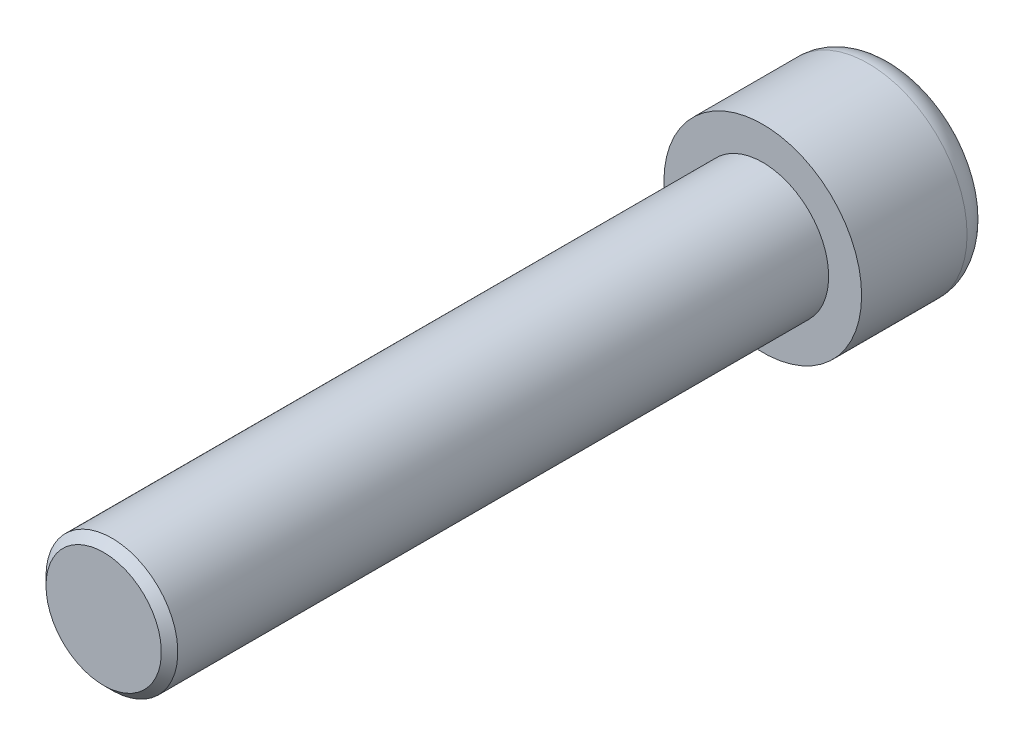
ISO-10303-21;
HEADER;
FILE_DESCRIPTION(('STEP AP214'),'2;1');
FILE_NAME('part.step','',(''),(''),'','','');
FILE_SCHEMA(('AUTOMOTIVE_DESIGN { 1 0 10303 214 1 1 1 1 }'));
ENDSEC;
DATA;
#1=APPLICATION_CONTEXT('core data for automotive mechanical design processes');
#2=APPLICATION_PROTOCOL_DEFINITION('international standard','automotive_design',2000,#1);
#3=PRODUCT_CONTEXT('',#1,'mechanical');
#4=PRODUCT('Part','Part','',(#3));
#5=PRODUCT_RELATED_PRODUCT_CATEGORY('part','',(#4));
#6=PRODUCT_DEFINITION_FORMATION('','',#4);
#7=PRODUCT_DEFINITION_CONTEXT('part definition',#1,'design');
#8=PRODUCT_DEFINITION('design','',#6,#7);
#9=PRODUCT_DEFINITION_SHAPE('','',#8);
#10=(LENGTH_UNIT() NAMED_UNIT(*) SI_UNIT(.MILLI.,.METRE.));
#11=(NAMED_UNIT(*) PLANE_ANGLE_UNIT() SI_UNIT($,.RADIAN.));
#12=(NAMED_UNIT(*) SI_UNIT($,.STERADIAN.) SOLID_ANGLE_UNIT());
#13=UNCERTAINTY_MEASURE_WITH_UNIT(LENGTH_MEASURE(1.E-05),#10,'distance_accuracy_value','');
#14=(GEOMETRIC_REPRESENTATION_CONTEXT(3) GLOBAL_UNCERTAINTY_ASSIGNED_CONTEXT((#13)) GLOBAL_UNIT_ASSIGNED_CONTEXT((#10,
#11,#12)) REPRESENTATION_CONTEXT('',''));
#15=CARTESIAN_POINT('',(0.,0.,0.));
#16=DIRECTION('',(0.,0.,1.));
#17=DIRECTION('',(1.,0.,0.));
#18=AXIS2_PLACEMENT_3D('',#15,#16,#17);
#19=CARTESIAN_POINT('',(0.,0.,16.));
#20=DIRECTION('',(0.,0.,0.999999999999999));
#21=DIRECTION('',(1.,0.,0.));
#22=AXIS2_PLACEMENT_3D('',#19,#20,#21);
#23=PLANE('',#22);
#24=CARTESIAN_POINT('',(0.,0.,16.));
#25=DIRECTION('',(0.,0.,0.999999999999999));
#26=DIRECTION('',(1.,0.,0.));
#27=AXIS2_PLACEMENT_3D('',#24,#25,#26);
#28=CIRCLE('',#27,12.);
#29=CARTESIAN_POINT('',(-12.,0.,16.));
#30=VERTEX_POINT('',#29);
#31=EDGE_CURVE('E137',#30,#30,#28,.T.);
#32=ORIENTED_EDGE('',*,*,#31,.T.);
#33=EDGE_LOOP('',(#32));
#34=FACE_BOUND('',#33,.T.);
#35=CARTESIAN_POINT('',(0.,0.,16.));
#36=DIRECTION('',(0.,0.,0.999999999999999));
#37=DIRECTION('',(1.,0.,0.));
#38=AXIS2_PLACEMENT_3D('',#35,#36,#37);
#39=CIRCLE('',#38,8.);
#40=CARTESIAN_POINT('',(-7.99999999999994,0.,15.9999999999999));
#41=VERTEX_POINT('',#40);
#42=EDGE_CURVE('E124',#41,#41,#39,.T.);
#43=ORIENTED_EDGE('',*,*,#42,.F.);
#44=EDGE_LOOP('',(#43));
#45=FACE_BOUND('',#44,.T.);
#46=ADVANCED_FACE('F34',(#34,#45),#23,.T.);
#47=CARTESIAN_POINT('',(0.,0.,16.));
#48=DIRECTION('',(0.,0.,-0.999999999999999));
#49=DIRECTION('',(-1.,0.,0.));
#50=AXIS2_PLACEMENT_3D('',#47,#48,#49);
#51=CYLINDRICAL_SURFACE('',#50,12.);
#52=CARTESIAN_POINT('',(2.22044604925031E-13,1.11022302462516E-13,3.2));
#53=DIRECTION('',(0.,0.,0.999999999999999));
#54=DIRECTION('',(1.,0.,0.));
#55=AXIS2_PLACEMENT_3D('',#52,#53,#54);
#56=CIRCLE('',#55,12.);
#57=CARTESIAN_POINT('',(-12.,0.,3.19999999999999));
#58=VERTEX_POINT('',#57);
#59=EDGE_CURVE('E42',#58,#58,#56,.T.);
#60=CARTESIAN_POINT('',(-12.,0.,3.19999999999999));
#61=CARTESIAN_POINT('',(-12.,0.,3.33333333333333));
#62=CARTESIAN_POINT('',(-12.,0.,3.46666666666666));
#63=CARTESIAN_POINT('',(-12.,0.,3.73333333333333));
#64=CARTESIAN_POINT('',(-12.,0.,3.86666666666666));
#65=CARTESIAN_POINT('',(-12.,0.,4.13333333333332));
#66=CARTESIAN_POINT('',(-12.,0.,4.26666666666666));
#67=CARTESIAN_POINT('',(-12.,0.,4.53333333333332));
#68=CARTESIAN_POINT('',(-12.,0.,4.66666666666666));
#69=CARTESIAN_POINT('',(-12.,0.,4.93333333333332));
#70=CARTESIAN_POINT('',(-12.,0.,5.06666666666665));
#71=CARTESIAN_POINT('',(-12.,0.,5.33333333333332));
#72=CARTESIAN_POINT('',(-12.,0.,5.46666666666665));
#73=CARTESIAN_POINT('',(-12.,0.,5.73333333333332));
#74=CARTESIAN_POINT('',(-12.,0.,5.86666666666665));
#75=CARTESIAN_POINT('',(-12.,0.,6.13333333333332));
#76=CARTESIAN_POINT('',(-12.,0.,6.26666666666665));
#77=CARTESIAN_POINT('',(-12.,0.,6.53333333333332));
#78=CARTESIAN_POINT('',(-12.,0.,6.66666666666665));
#79=CARTESIAN_POINT('',(-12.,0.,6.93333333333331));
#80=CARTESIAN_POINT('',(-12.,0.,7.06666666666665));
#81=CARTESIAN_POINT('',(-12.,0.,7.33333333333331));
#82=CARTESIAN_POINT('',(-12.,0.,7.46666666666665));
#83=CARTESIAN_POINT('',(-12.,0.,7.73333333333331));
#84=CARTESIAN_POINT('',(-12.,0.,7.86666666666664));
#85=CARTESIAN_POINT('',(-12.,0.,8.13333333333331));
#86=CARTESIAN_POINT('',(-12.,0.,8.26666666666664));
#87=CARTESIAN_POINT('',(-12.,0.,8.53333333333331));
#88=CARTESIAN_POINT('',(-12.,0.,8.66666666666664));
#89=CARTESIAN_POINT('',(-12.,0.,8.93333333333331));
#90=CARTESIAN_POINT('',(-12.,0.,9.06666666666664));
#91=CARTESIAN_POINT('',(-12.,0.,9.33333333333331));
#92=CARTESIAN_POINT('',(-12.,0.,9.46666666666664));
#93=CARTESIAN_POINT('',(-12.,0.,9.73333333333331));
#94=CARTESIAN_POINT('',(-12.,0.,9.86666666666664));
#95=CARTESIAN_POINT('',(-12.,0.,10.1333333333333));
#96=CARTESIAN_POINT('',(-12.,0.,10.2666666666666));
#97=CARTESIAN_POINT('',(-12.,0.,10.5333333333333));
#98=CARTESIAN_POINT('',(-12.,0.,10.6666666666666));
#99=CARTESIAN_POINT('',(-12.,0.,10.9333333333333));
#100=CARTESIAN_POINT('',(-12.,0.,11.0666666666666));
#101=CARTESIAN_POINT('',(-12.,0.,11.3333333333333));
#102=CARTESIAN_POINT('',(-12.,0.,11.4666666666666));
#103=CARTESIAN_POINT('',(-12.,0.,11.7333333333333));
#104=CARTESIAN_POINT('',(-12.,0.,11.8666666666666));
#105=CARTESIAN_POINT('',(-12.,0.,12.1333333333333));
#106=CARTESIAN_POINT('',(-12.,0.,12.2666666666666));
#107=CARTESIAN_POINT('',(-12.,0.,12.5333333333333));
#108=CARTESIAN_POINT('',(-12.,0.,12.6666666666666));
#109=CARTESIAN_POINT('',(-12.,0.,12.9333333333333));
#110=CARTESIAN_POINT('',(-12.,0.,13.0666666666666));
#111=CARTESIAN_POINT('',(-12.,0.,13.3333333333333));
#112=CARTESIAN_POINT('',(-12.,0.,13.4666666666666));
#113=CARTESIAN_POINT('',(-12.,0.,13.7333333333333));
#114=CARTESIAN_POINT('',(-12.,0.,13.8666666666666));
#115=CARTESIAN_POINT('',(-12.,0.,14.1333333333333));
#116=CARTESIAN_POINT('',(-12.,0.,14.2666666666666));
#117=CARTESIAN_POINT('',(-12.,0.,14.5333333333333));
#118=CARTESIAN_POINT('',(-12.,0.,14.6666666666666));
#119=CARTESIAN_POINT('',(-12.,0.,14.9333333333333));
#120=CARTESIAN_POINT('',(-12.,0.,15.0666666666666));
#121=CARTESIAN_POINT('',(-12.,0.,15.3333333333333));
#122=CARTESIAN_POINT('',(-12.,0.,15.4666666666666));
#123=CARTESIAN_POINT('',(-12.,0.,15.7333333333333));
#124=CARTESIAN_POINT('',(-12.,0.,15.8666666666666));
#125=CARTESIAN_POINT('',(-12.,0.,16.));
#126=B_SPLINE_CURVE_WITH_KNOTS('',3,(#60,#61,#62,#63,#64,#65,#66,#67,#68,#69,#70,#71,#72,#73,
#74,#75,#76,#77,#78,#79,#80,#81,#82,#83,#84,#85,#86,#87,#88,#89,#90,#91,#92,#93,#94,#95,#96,#97,
#98,#99,#100,#101,#102,#103,#104,#105,#106,#107,#108,#109,#110,#111,#112,#113,#114,#115,#116,
#117,#118,#119,#120,#121,#122,#123,#124,#125),.UNSPECIFIED.,.F.,.F.,(4,2,2,2,2,2,2,2,2,2,2,2,2,
2,2,2,2,2,2,2,2,2,2,2,2,2,2,2,2,2,2,2,4),(0.,0.399999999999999,0.799999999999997,1.2,1.6,
1.99999999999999,2.39999999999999,2.79999999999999,3.19999999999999,3.59999999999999,
3.99999999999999,4.39999999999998,4.79999999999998,5.19999999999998,5.59999999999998,
5.99999999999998,6.39999999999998,6.79999999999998,7.19999999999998,7.59999999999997,
7.99999999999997,8.39999999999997,8.79999999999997,9.19999999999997,9.59999999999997,
9.99999999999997,10.4,10.8,11.2,11.6,12.,12.4,12.8),.UNSPECIFIED.);
#127=EDGE_CURVE('BSEAM147',#58,#30,#126,.T.);
#128=ORIENTED_EDGE('',*,*,#59,.T.);
#129=ORIENTED_EDGE('',*,*,#31,.F.);
#130=ORIENTED_EDGE('',*,*,#127,.T.);
#131=ORIENTED_EDGE('',*,*,#127,.F.);
#132=EDGE_LOOP('',(#128,#130,#129,#131));
#133=FACE_BOUND('',#132,.T.);
#134=ADVANCED_FACE('F147',(#133),#51,.T.);
#135=CARTESIAN_POINT('',(0.,-2.77555756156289E-13,0.));
#136=DIRECTION('',(0.,0.,0.999999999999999));
#137=DIRECTION('',(1.,0.,0.));
#138=AXIS2_PLACEMENT_3D('',#135,#136,#137);
#139=PLANE('',#138);
#140=CARTESIAN_POINT('',(0.,-2.77555756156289E-13,0.));
#141=DIRECTION('',(0.,0.,0.999999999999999));
#142=DIRECTION('',(1.,0.,0.));
#143=AXIS2_PLACEMENT_3D('',#140,#141,#142);
#144=CIRCLE('',#143,8.8);
#145=CARTESIAN_POINT('',(8.80000000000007,-2.77067258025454E-13,0.));
#146=VERTEX_POINT('',#145);
#147=EDGE_CURVE('E11',#146,#146,#144,.F.);
#148=ORIENTED_EDGE('',*,*,#147,.T.);
#149=EDGE_LOOP('',(#148));
#150=FACE_BOUND('',#149,.T.);
#151=DIRECTION('',(0.866025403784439,-0.500000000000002,0.));
#152=VECTOR('',#151,1.);
#153=CARTESIAN_POINT('',(0.,8.082903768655,0.));
#154=LINE('',#153,#152);
#155=CARTESIAN_POINT('',(0.,8.082903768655,0.));
#156=VERTEX_POINT('',#155);
#157=CARTESIAN_POINT('',(7.00000000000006,4.04145188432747,0.));
#158=VERTEX_POINT('',#157);
#159=EDGE_CURVE('E123',#156,#158,#154,.T.);
#160=ORIENTED_EDGE('',*,*,#159,.F.);
#161=DIRECTION('',(0.866025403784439,0.500000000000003,0.));
#162=VECTOR('',#161,1.);
#163=CARTESIAN_POINT('',(0.,8.082903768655,0.));
#164=LINE('',#163,#162);
#165=CARTESIAN_POINT('',(-7.00000000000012,4.04145188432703,0.));
#166=VERTEX_POINT('',#165);
#167=EDGE_CURVE('E49',#166,#156,#164,.T.);
#168=ORIENTED_EDGE('',*,*,#167,.F.);
#169=DIRECTION('',(0.,1.,0.));
#170=VECTOR('',#169,1.);
#171=CARTESIAN_POINT('',(-7.00000000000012,4.04145188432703,0.));
#172=LINE('',#171,#170);
#173=CARTESIAN_POINT('',(-7.00000000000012,-4.0414518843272,0.));
#174=VERTEX_POINT('',#173);
#175=EDGE_CURVE('E133',#174,#166,#172,.T.);
#176=ORIENTED_EDGE('',*,*,#175,.F.);
#177=DIRECTION('',(-0.866025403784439,0.500000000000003,0.));
#178=VECTOR('',#177,1.);
#179=CARTESIAN_POINT('',(-7.00000000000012,-4.0414518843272,0.));
#180=LINE('',#179,#178);
#181=CARTESIAN_POINT('',(0.,-8.08290376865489,0.));
#182=VERTEX_POINT('',#181);
#183=EDGE_CURVE('E131',#182,#174,#180,.T.);
#184=ORIENTED_EDGE('',*,*,#183,.F.);
#185=DIRECTION('',(-0.866025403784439,-0.500000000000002,0.));
#186=VECTOR('',#185,1.);
#187=CARTESIAN_POINT('',(7.00000000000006,-4.04145188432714,0.));
#188=LINE('',#187,#186);
#189=CARTESIAN_POINT('',(7.00000000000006,-4.04145188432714,0.));
#190=VERTEX_POINT('',#189);
#191=EDGE_CURVE('E97',#190,#182,#188,.T.);
#192=ORIENTED_EDGE('',*,*,#191,.F.);
#193=DIRECTION('',(0.,-1.,0.));
#194=VECTOR('',#193,1.);
#195=CARTESIAN_POINT('',(7.00000000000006,4.04145188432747,0.));
#196=LINE('',#195,#194);
#197=EDGE_CURVE('E127',#158,#190,#196,.T.);
#198=ORIENTED_EDGE('',*,*,#197,.F.);
#199=EDGE_LOOP('',(#160,#168,#176,#184,#192,#198));
#200=FACE_BOUND('',#199,.T.);
#201=ADVANCED_FACE('F169',(#150,#200),#139,.F.);
#202=CARTESIAN_POINT('',(0.,8.0829037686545,9.99999999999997));
#203=DIRECTION('',(-0.500000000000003,0.866025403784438,0.));
#204=DIRECTION('',(-0.866025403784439,-0.500000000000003,0.));
#205=AXIS2_PLACEMENT_3D('',#202,#203,#204);
#206=PLANE('',#205);
#207=ORIENTED_EDGE('',*,*,#167,.T.);
#208=DIRECTION('',(0.,0.,-0.999999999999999));
#209=VECTOR('',#208,1.);
#210=CARTESIAN_POINT('',(0.,8.0829037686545,9.99999999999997));
#211=LINE('',#210,#209);
#212=CARTESIAN_POINT('',(0.,8.0829037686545,9.99999999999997));
#213=VERTEX_POINT('',#212);
#214=EDGE_CURVE('E79',#213,#156,#211,.T.);
#215=ORIENTED_EDGE('',*,*,#214,.F.);
#216=DIRECTION('',(0.866025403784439,0.500000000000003,0.));
#217=VECTOR('',#216,1.);
#218=CARTESIAN_POINT('',(0.,8.0829037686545,9.99999999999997));
#219=LINE('',#218,#217);
#220=CARTESIAN_POINT('',(-7.00000000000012,4.04145188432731,9.99999999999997));
#221=VERTEX_POINT('',#220);
#222=EDGE_CURVE('E135',#221,#213,#219,.T.);
#223=ORIENTED_EDGE('',*,*,#222,.F.);
#224=DIRECTION('',(0.,0.,-0.999999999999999));
#225=VECTOR('',#224,1.);
#226=CARTESIAN_POINT('',(-7.00000000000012,4.04145188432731,9.99999999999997));
#227=LINE('',#226,#225);
#228=EDGE_CURVE('E57',#221,#166,#227,.T.);
#229=ORIENTED_EDGE('',*,*,#228,.T.);
#230=EDGE_LOOP('',(#207,#215,#223,#229));
#231=FACE_BOUND('',#230,.T.);
#232=ADVANCED_FACE('F173',(#231),#206,.F.);
#233=CARTESIAN_POINT('',(-7.00000000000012,4.04145188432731,9.99999999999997));
#234=DIRECTION('',(-1.,0.,0.));
#235=DIRECTION('',(0.,0.,0.999999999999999));
#236=AXIS2_PLACEMENT_3D('',#233,#234,#235);
#237=PLANE('',#236);
#238=ORIENTED_EDGE('',*,*,#175,.T.);
#239=ORIENTED_EDGE('',*,*,#228,.F.);
#240=DIRECTION('',(0.,1.,0.));
#241=VECTOR('',#240,1.);
#242=CARTESIAN_POINT('',(-7.00000000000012,4.04145188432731,9.99999999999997));
#243=LINE('',#242,#241);
#244=CARTESIAN_POINT('',(-6.99999999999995,-4.04145188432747,9.99999999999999));
#245=VERTEX_POINT('',#244);
#246=EDGE_CURVE('E109',#245,#221,#243,.T.);
#247=ORIENTED_EDGE('',*,*,#246,.F.);
#248=DIRECTION('',(0.,0.,-0.999999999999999));
#249=VECTOR('',#248,1.);
#250=CARTESIAN_POINT('',(-6.99999999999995,-4.04145188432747,9.99999999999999));
#251=LINE('',#250,#249);
#252=EDGE_CURVE('E101',#245,#174,#251,.T.);
#253=ORIENTED_EDGE('',*,*,#252,.T.);
#254=EDGE_LOOP('',(#238,#239,#247,#253));
#255=FACE_BOUND('',#254,.T.);
#256=ADVANCED_FACE('F180',(#255),#237,.F.);
#257=CARTESIAN_POINT('',(-6.99999999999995,-4.04145188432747,9.99999999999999));
#258=DIRECTION('',(-0.500000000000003,-0.866025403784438,0.));
#259=DIRECTION('',(0.866025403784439,-0.500000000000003,0.));
#260=AXIS2_PLACEMENT_3D('',#257,#258,#259);
#261=PLANE('',#260);
#262=ORIENTED_EDGE('',*,*,#183,.T.);
#263=ORIENTED_EDGE('',*,*,#252,.F.);
#264=DIRECTION('',(-0.866025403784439,0.500000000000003,0.));
#265=VECTOR('',#264,1.);
#266=CARTESIAN_POINT('',(-6.99999999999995,-4.04145188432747,9.99999999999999));
#267=LINE('',#266,#265);
#268=CARTESIAN_POINT('',(-1.11022302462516E-13,-8.08290376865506,9.99999999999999));
#269=VERTEX_POINT('',#268);
#270=EDGE_CURVE('E105',#269,#245,#267,.T.);
#271=ORIENTED_EDGE('',*,*,#270,.F.);
#272=DIRECTION('',(0.,0.,-0.999999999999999));
#273=VECTOR('',#272,1.);
#274=CARTESIAN_POINT('',(-1.11022302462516E-13,-8.08290376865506,9.99999999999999));
#275=LINE('',#274,#273);
#276=EDGE_CURVE('E90',#269,#182,#275,.T.);
#277=ORIENTED_EDGE('',*,*,#276,.T.);
#278=EDGE_LOOP('',(#262,#263,#271,#277));
#279=FACE_BOUND('',#278,.T.);
#280=ADVANCED_FACE('F106',(#279),#261,.F.);
#281=CARTESIAN_POINT('',(6.99999999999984,-4.04145188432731,9.99999999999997));
#282=DIRECTION('',(0.500000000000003,-0.866025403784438,0.));
#283=DIRECTION('',(0.866025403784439,0.500000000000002,0.));
#284=AXIS2_PLACEMENT_3D('',#281,#282,#283);
#285=PLANE('',#284);
#286=ORIENTED_EDGE('',*,*,#191,.T.);
#287=ORIENTED_EDGE('',*,*,#276,.F.);
#288=DIRECTION('',(-0.866025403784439,-0.500000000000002,0.));
#289=VECTOR('',#288,1.);
#290=CARTESIAN_POINT('',(6.99999999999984,-4.04145188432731,9.99999999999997));
#291=LINE('',#290,#289);
#292=CARTESIAN_POINT('',(6.99999999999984,-4.04145188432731,9.99999999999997));
#293=VERTEX_POINT('',#292);
#294=EDGE_CURVE('E94',#293,#269,#291,.T.);
#295=ORIENTED_EDGE('',*,*,#294,.F.);
#296=DIRECTION('',(0.,0.,-0.999999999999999));
#297=VECTOR('',#296,1.);
#298=CARTESIAN_POINT('',(6.99999999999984,-4.04145188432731,9.99999999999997));
#299=LINE('',#298,#297);
#300=EDGE_CURVE('E102',#293,#190,#299,.T.);
#301=ORIENTED_EDGE('',*,*,#300,.T.);
#302=EDGE_LOOP('',(#286,#287,#295,#301));
#303=FACE_BOUND('',#302,.T.);
#304=ADVANCED_FACE('F92',(#303),#285,.F.);
#305=CARTESIAN_POINT('',(6.99999999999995,4.04145188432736,9.99999999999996));
#306=DIRECTION('',(1.,0.,0.));
#307=DIRECTION('',(0.,0.,-0.999999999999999));
#308=AXIS2_PLACEMENT_3D('',#305,#306,#307);
#309=PLANE('',#308);
#310=ORIENTED_EDGE('',*,*,#197,.T.);
#311=ORIENTED_EDGE('',*,*,#300,.F.);
#312=DIRECTION('',(0.,-1.,0.));
#313=VECTOR('',#312,1.);
#314=CARTESIAN_POINT('',(6.99999999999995,4.04145188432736,9.99999999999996));
#315=LINE('',#314,#313);
#316=CARTESIAN_POINT('',(6.99999999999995,4.04145188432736,9.99999999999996));
#317=VERTEX_POINT('',#316);
#318=EDGE_CURVE('E115',#317,#293,#315,.T.);
#319=ORIENTED_EDGE('',*,*,#318,.F.);
#320=DIRECTION('',(0.,0.,-0.999999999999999));
#321=VECTOR('',#320,1.);
#322=CARTESIAN_POINT('',(6.99999999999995,4.04145188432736,9.99999999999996));
#323=LINE('',#322,#321);
#324=EDGE_CURVE('E140',#317,#158,#323,.T.);
#325=ORIENTED_EDGE('',*,*,#324,.T.);
#326=EDGE_LOOP('',(#310,#311,#319,#325));
#327=FACE_BOUND('',#326,.T.);
#328=ADVANCED_FACE('F215',(#327),#309,.F.);
#329=CARTESIAN_POINT('',(0.,8.0829037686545,9.99999999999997));
#330=DIRECTION('',(0.500000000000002,0.866025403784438,0.));
#331=DIRECTION('',(-0.866025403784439,0.500000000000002,0.));
#332=AXIS2_PLACEMENT_3D('',#329,#330,#331);
#333=PLANE('',#332);
#334=ORIENTED_EDGE('',*,*,#159,.T.);
#335=ORIENTED_EDGE('',*,*,#324,.F.);
#336=DIRECTION('',(0.866025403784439,-0.500000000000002,0.));
#337=VECTOR('',#336,1.);
#338=CARTESIAN_POINT('',(0.,8.0829037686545,9.99999999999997));
#339=LINE('',#338,#337);
#340=EDGE_CURVE('E117',#213,#317,#339,.T.);
#341=ORIENTED_EDGE('',*,*,#340,.F.);
#342=ORIENTED_EDGE('',*,*,#214,.T.);
#343=EDGE_LOOP('',(#334,#335,#341,#342));
#344=FACE_BOUND('',#343,.T.);
#345=ADVANCED_FACE('F160',(#344),#333,.F.);
#346=CARTESIAN_POINT('',(-14.,0.,9.99999999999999));
#347=DIRECTION('',(0.,0.,0.999999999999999));
#348=DIRECTION('',(1.,0.,0.));
#349=AXIS2_PLACEMENT_3D('',#346,#347,#348);
#350=PLANE('',#349);
#351=ORIENTED_EDGE('',*,*,#222,.T.);
#352=ORIENTED_EDGE('',*,*,#340,.T.);
#353=ORIENTED_EDGE('',*,*,#318,.T.);
#354=ORIENTED_EDGE('',*,*,#294,.T.);
#355=ORIENTED_EDGE('',*,*,#270,.T.);
#356=ORIENTED_EDGE('',*,*,#246,.T.);
#357=EDGE_LOOP('',(#351,#352,#353,#354,#355,#356));
#358=FACE_BOUND('',#357,.T.);
#359=ADVANCED_FACE('F112',(#358),#350,.F.);
#360=CARTESIAN_POINT('',(2.22044604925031E-13,1.11022302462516E-13,3.2));
#361=DIRECTION('',(0.,0.,0.999999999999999));
#362=DIRECTION('',(1.,0.,0.));
#363=AXIS2_PLACEMENT_3D('',#360,#361,#362);
#364=TOROIDAL_SURFACE('',#363,8.8,3.2);
#365=ORIENTED_EDGE('',*,*,#147,.F.);
#366=EDGE_LOOP('',(#365));
#367=FACE_BOUND('',#366,.T.);
#368=ORIENTED_EDGE('',*,*,#59,.F.);
#369=EDGE_LOOP('',(#368));
#370=FACE_BOUND('',#369,.T.);
#371=ADVANCED_FACE('F36',(#367,#370),#364,.T.);
#372=CARTESIAN_POINT('',(0.,0.,95.9999999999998));
#373=DIRECTION('',(0.,0.,-0.999999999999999));
#374=DIRECTION('',(-1.,0.,0.));
#375=AXIS2_PLACEMENT_3D('',#372,#373,#374);
#376=CYLINDRICAL_SURFACE('',#375,8.);
#377=CARTESIAN_POINT('',(1.11022302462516E-13,3.33066907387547E-13,94.9999999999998));
#378=DIRECTION('',(0.,0.,-0.999999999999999));
#379=DIRECTION('',(-1.,0.,0.));
#380=AXIS2_PLACEMENT_3D('',#377,#378,#379);
#381=CIRCLE('',#380,8.);
#382=CARTESIAN_POINT('',(-7.99999999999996,0.,94.9999999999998));
#383=VERTEX_POINT('',#382);
#384=EDGE_CURVE('E193',#383,#383,#381,.T.);
#385=CARTESIAN_POINT('',(-7.99999999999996,0.,94.9999999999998));
#386=CARTESIAN_POINT('',(-7.99999999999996,0.,94.1770833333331));
#387=CARTESIAN_POINT('',(-7.99999999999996,0.,93.3541666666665));
#388=CARTESIAN_POINT('',(-7.99999999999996,0.,91.7083333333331));
#389=CARTESIAN_POINT('',(-7.99999999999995,0.,90.8854166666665));
#390=CARTESIAN_POINT('',(-7.99999999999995,0.,89.2395833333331));
#391=CARTESIAN_POINT('',(-7.99999999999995,0.,88.4166666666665));
#392=CARTESIAN_POINT('',(-7.99999999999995,0.,86.7708333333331));
#393=CARTESIAN_POINT('',(-7.99999999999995,0.,85.9479166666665));
#394=CARTESIAN_POINT('',(-7.99999999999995,0.,84.3020833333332));
#395=CARTESIAN_POINT('',(-7.99999999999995,0.,83.4791666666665));
#396=CARTESIAN_POINT('',(-7.99999999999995,0.,81.8333333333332));
#397=CARTESIAN_POINT('',(-7.99999999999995,0.,81.0104166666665));
#398=CARTESIAN_POINT('',(-7.99999999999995,0.,79.3645833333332));
#399=CARTESIAN_POINT('',(-7.99999999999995,0.,78.5416666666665));
#400=CARTESIAN_POINT('',(-7.99999999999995,0.,76.8958333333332));
#401=CARTESIAN_POINT('',(-7.99999999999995,0.,76.0729166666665));
#402=CARTESIAN_POINT('',(-7.99999999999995,0.,74.4270833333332));
#403=CARTESIAN_POINT('',(-7.99999999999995,0.,73.6041666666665));
#404=CARTESIAN_POINT('',(-7.99999999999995,0.,71.9583333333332));
#405=CARTESIAN_POINT('',(-7.99999999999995,0.,71.1354166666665));
#406=CARTESIAN_POINT('',(-7.99999999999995,0.,69.4895833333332));
#407=CARTESIAN_POINT('',(-7.99999999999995,0.,68.6666666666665));
#408=CARTESIAN_POINT('',(-7.99999999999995,0.,67.0208333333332));
#409=CARTESIAN_POINT('',(-7.99999999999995,0.,66.1979166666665));
#410=CARTESIAN_POINT('',(-7.99999999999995,0.,64.5520833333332));
#411=CARTESIAN_POINT('',(-7.99999999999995,0.,63.7291666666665));
#412=CARTESIAN_POINT('',(-7.99999999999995,0.,62.0833333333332));
#413=CARTESIAN_POINT('',(-7.99999999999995,0.,61.2604166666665));
#414=CARTESIAN_POINT('',(-7.99999999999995,0.,59.6145833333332));
#415=CARTESIAN_POINT('',(-7.99999999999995,0.,58.7916666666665));
#416=CARTESIAN_POINT('',(-7.99999999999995,0.,57.1458333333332));
#417=CARTESIAN_POINT('',(-7.99999999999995,0.,56.3229166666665));
#418=CARTESIAN_POINT('',(-7.99999999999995,0.,54.6770833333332));
#419=CARTESIAN_POINT('',(-7.99999999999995,0.,53.8541666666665));
#420=CARTESIAN_POINT('',(-7.99999999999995,0.,52.2083333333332));
#421=CARTESIAN_POINT('',(-7.99999999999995,0.,51.3854166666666));
#422=CARTESIAN_POINT('',(-7.99999999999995,0.,49.7395833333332));
#423=CARTESIAN_POINT('',(-7.99999999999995,0.,48.9166666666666));
#424=CARTESIAN_POINT('',(-7.99999999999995,0.,47.2708333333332));
#425=CARTESIAN_POINT('',(-7.99999999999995,0.,46.4479166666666));
#426=CARTESIAN_POINT('',(-7.99999999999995,0.,44.8020833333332));
#427=CARTESIAN_POINT('',(-7.99999999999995,0.,43.9791666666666));
#428=CARTESIAN_POINT('',(-7.99999999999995,0.,42.3333333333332));
#429=CARTESIAN_POINT('',(-7.99999999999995,0.,41.5104166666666));
#430=CARTESIAN_POINT('',(-7.99999999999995,0.,39.8645833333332));
#431=CARTESIAN_POINT('',(-7.99999999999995,0.,39.0416666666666));
#432=CARTESIAN_POINT('',(-7.99999999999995,0.,37.3958333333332));
#433=CARTESIAN_POINT('',(-7.99999999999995,0.,36.5729166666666));
#434=CARTESIAN_POINT('',(-7.99999999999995,0.,34.9270833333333));
#435=CARTESIAN_POINT('',(-7.99999999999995,0.,34.1041666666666));
#436=CARTESIAN_POINT('',(-7.99999999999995,0.,32.4583333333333));
#437=CARTESIAN_POINT('',(-7.99999999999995,0.,31.6354166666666));
#438=CARTESIAN_POINT('',(-7.99999999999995,0.,29.9895833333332));
#439=CARTESIAN_POINT('',(-7.99999999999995,0.,29.1666666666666));
#440=CARTESIAN_POINT('',(-7.99999999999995,0.,27.5208333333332));
#441=CARTESIAN_POINT('',(-7.99999999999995,0.,26.6979166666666));
#442=CARTESIAN_POINT('',(-7.99999999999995,0.,25.0520833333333));
#443=CARTESIAN_POINT('',(-7.99999999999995,0.,24.2291666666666));
#444=CARTESIAN_POINT('',(-7.99999999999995,0.,22.5833333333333));
#445=CARTESIAN_POINT('',(-7.99999999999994,0.,21.7604166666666));
#446=CARTESIAN_POINT('',(-7.99999999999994,0.,20.1145833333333));
#447=CARTESIAN_POINT('',(-7.99999999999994,0.,19.2916666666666));
#448=CARTESIAN_POINT('',(-7.99999999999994,0.,17.6458333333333));
#449=CARTESIAN_POINT('',(-7.99999999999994,0.,16.8229166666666));
#450=CARTESIAN_POINT('',(-7.99999999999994,0.,15.9999999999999));
#451=B_SPLINE_CURVE_WITH_KNOTS('',3,(#385,#386,#387,#388,#389,#390,#391,#392,#393,#394,#395,
#396,#397,#398,#399,#400,#401,#402,#403,#404,#405,#406,#407,#408,#409,#410,#411,#412,#413,#414,
#415,#416,#417,#418,#419,#420,#421,#422,#423,#424,#425,#426,#427,#428,#429,#430,#431,#432,#433,
#434,#435,#436,#437,#438,#439,#440,#441,#442,#443,#444,#445,#446,#447,#448,#449,#450),
.UNSPECIFIED.,.F.,.F.,(4,2,2,2,2,2,2,2,2,2,2,2,2,2,2,2,2,2,2,2,2,2,2,2,2,2,2,2,2,2,2,2,4),(0.,
2.46875000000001,4.9375,7.40624999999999,9.87499999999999,12.34375,14.8125,17.28125,19.75,
22.21875,24.6875,27.15625,29.625,32.09375,34.5624999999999,37.0312499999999,39.4999999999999,
41.9687499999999,44.4374999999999,46.9062499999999,49.3749999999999,51.8437499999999,
54.3124999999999,56.7812499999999,59.2499999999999,61.7187499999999,64.1874999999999,
66.6562499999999,69.1249999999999,71.5937499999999,74.0624999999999,76.5312499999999,
78.9999999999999),.UNSPECIFIED.);
#452=EDGE_CURVE('BSEAM151',#383,#41,#451,.T.);
#453=ORIENTED_EDGE('',*,*,#384,.T.);
#454=ORIENTED_EDGE('',*,*,#42,.T.);
#455=ORIENTED_EDGE('',*,*,#452,.T.);
#456=ORIENTED_EDGE('',*,*,#452,.F.);
#457=EDGE_LOOP('',(#453,#455,#454,#456));
#458=FACE_BOUND('',#457,.T.);
#459=ADVANCED_FACE('F151',(#458),#376,.T.);
#460=CARTESIAN_POINT('',(0.,0.,95.9999999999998));
#461=DIRECTION('',(0.,0.,-0.999999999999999));
#462=DIRECTION('',(-1.,0.,0.));
#463=AXIS2_PLACEMENT_3D('',#460,#461,#462);
#464=CONICAL_SURFACE('',#463,6.99999999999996,0.785398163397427);
#465=CARTESIAN_POINT('',(0.,0.,95.9999999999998));
#466=DIRECTION('',(0.,0.,-0.999999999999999));
#467=DIRECTION('',(-1.,0.,0.));
#468=AXIS2_PLACEMENT_3D('',#465,#466,#467);
#469=CIRCLE('',#468,6.99999999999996);
#470=CARTESIAN_POINT('',(-6.99999999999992,0.,95.9999999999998));
#471=VERTEX_POINT('',#470);
#472=EDGE_CURVE('E190',#471,#471,#469,.T.);
#473=CARTESIAN_POINT('',(-7.9999999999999,0.,94.9999999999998));
#474=CARTESIAN_POINT('',(-7.98958333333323,0.,95.0104166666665));
#475=CARTESIAN_POINT('',(-7.97916666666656,0.,95.0208333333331));
#476=CARTESIAN_POINT('',(-7.95833333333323,0.,95.0416666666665));
#477=CARTESIAN_POINT('',(-7.94791666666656,0.,95.0520833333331));
#478=CARTESIAN_POINT('',(-7.92708333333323,0.,95.0729166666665));
#479=CARTESIAN_POINT('',(-7.91666666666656,0.,95.0833333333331));
#480=CARTESIAN_POINT('',(-7.89583333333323,0.,95.1041666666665));
#481=CARTESIAN_POINT('',(-7.88541666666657,0.,95.1145833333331));
#482=CARTESIAN_POINT('',(-7.86458333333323,0.,95.1354166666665));
#483=CARTESIAN_POINT('',(-7.85416666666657,0.,95.1458333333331));
#484=CARTESIAN_POINT('',(-7.83333333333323,0.,95.1666666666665));
#485=CARTESIAN_POINT('',(-7.82291666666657,0.,95.1770833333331));
#486=CARTESIAN_POINT('',(-7.80208333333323,0.,95.1979166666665));
#487=CARTESIAN_POINT('',(-7.79166666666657,0.,95.2083333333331));
#488=CARTESIAN_POINT('',(-7.77083333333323,0.,95.2291666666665));
#489=CARTESIAN_POINT('',(-7.76041666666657,0.,95.2395833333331));
#490=CARTESIAN_POINT('',(-7.73958333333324,0.,95.2604166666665));
#491=CARTESIAN_POINT('',(-7.72916666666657,0.,95.2708333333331));
#492=CARTESIAN_POINT('',(-7.70833333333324,0.,95.2916666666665));
#493=CARTESIAN_POINT('',(-7.69791666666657,0.,95.3020833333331));
#494=CARTESIAN_POINT('',(-7.67708333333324,0.,95.3229166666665));
#495=CARTESIAN_POINT('',(-7.66666666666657,0.,95.3333333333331));
#496=CARTESIAN_POINT('',(-7.64583333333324,0.,95.3541666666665));
#497=CARTESIAN_POINT('',(-7.63541666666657,0.,95.3645833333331));
#498=CARTESIAN_POINT('',(-7.61458333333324,0.,95.3854166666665));
#499=CARTESIAN_POINT('',(-7.60416666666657,0.,95.3958333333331));
#500=CARTESIAN_POINT('',(-7.58333333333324,0.,95.4166666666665));
#501=CARTESIAN_POINT('',(-7.57291666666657,0.,95.4270833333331));
#502=CARTESIAN_POINT('',(-7.55208333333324,0.,95.4479166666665));
#503=CARTESIAN_POINT('',(-7.54166666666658,0.,95.4583333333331));
#504=CARTESIAN_POINT('',(-7.52083333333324,0.,95.4791666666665));
#505=CARTESIAN_POINT('',(-7.51041666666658,0.,95.4895833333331));
#506=CARTESIAN_POINT('',(-7.48958333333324,0.,95.5104166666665));
#507=CARTESIAN_POINT('',(-7.47916666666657,0.,95.5208333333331));
#508=CARTESIAN_POINT('',(-7.45833333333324,0.,95.5416666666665));
#509=CARTESIAN_POINT('',(-7.44791666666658,0.,95.5520833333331));
#510=CARTESIAN_POINT('',(-7.42708333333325,0.,95.5729166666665));
#511=CARTESIAN_POINT('',(-7.41666666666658,0.,95.5833333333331));
#512=CARTESIAN_POINT('',(-7.39583333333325,0.,95.6041666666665));
#513=CARTESIAN_POINT('',(-7.38541666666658,0.,95.6145833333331));
#514=CARTESIAN_POINT('',(-7.36458333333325,0.,95.6354166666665));
#515=CARTESIAN_POINT('',(-7.35416666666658,0.,95.6458333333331));
#516=CARTESIAN_POINT('',(-7.33333333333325,0.,95.6666666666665));
#517=CARTESIAN_POINT('',(-7.32291666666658,0.,95.6770833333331));
#518=CARTESIAN_POINT('',(-7.30208333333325,0.,95.6979166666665));
#519=CARTESIAN_POINT('',(-7.29166666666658,0.,95.7083333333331));
#520=CARTESIAN_POINT('',(-7.27083333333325,0.,95.7291666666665));
#521=CARTESIAN_POINT('',(-7.26041666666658,0.,95.7395833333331));
#522=CARTESIAN_POINT('',(-7.23958333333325,0.,95.7604166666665));
#523=CARTESIAN_POINT('',(-7.22916666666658,0.,95.7708333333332));
#524=CARTESIAN_POINT('',(-7.20833333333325,0.,95.7916666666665));
#525=CARTESIAN_POINT('',(-7.19791666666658,0.,95.8020833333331));
#526=CARTESIAN_POINT('',(-7.17708333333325,0.,95.8229166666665));
#527=CARTESIAN_POINT('',(-7.16666666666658,0.,95.8333333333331));
#528=CARTESIAN_POINT('',(-7.14583333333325,0.,95.8541666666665));
#529=CARTESIAN_POINT('',(-7.13541666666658,0.,95.8645833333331));
#530=CARTESIAN_POINT('',(-7.11458333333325,0.,95.8854166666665));
#531=CARTESIAN_POINT('',(-7.10416666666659,0.,95.8958333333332));
#532=CARTESIAN_POINT('',(-7.08333333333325,0.,95.9166666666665));
#533=CARTESIAN_POINT('',(-7.07291666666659,0.,95.9270833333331));
#534=CARTESIAN_POINT('',(-7.05208333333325,0.,95.9479166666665));
#535=CARTESIAN_POINT('',(-7.04166666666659,0.,95.9583333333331));
#536=CARTESIAN_POINT('',(-7.02083333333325,0.,95.9791666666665));
#537=CARTESIAN_POINT('',(-7.01041666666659,0.,95.9895833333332));
#538=CARTESIAN_POINT('',(-6.99999999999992,0.,95.9999999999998));
#539=B_SPLINE_CURVE_WITH_KNOTS('',3,(#473,#474,#475,#476,#477,#478,#479,#480,#481,#482,#483,
#484,#485,#486,#487,#488,#489,#490,#491,#492,#493,#494,#495,#496,#497,#498,#499,#500,#501,#502,
#503,#504,#505,#506,#507,#508,#509,#510,#511,#512,#513,#514,#515,#516,#517,#518,#519,#520,#521,
#522,#523,#524,#525,#526,#527,#528,#529,#530,#531,#532,#533,#534,#535,#536,#537,#538),
.UNSPECIFIED.,.F.,.F.,(4,2,2,2,2,2,2,2,2,2,2,2,2,2,2,2,2,2,2,2,2,2,2,2,2,2,2,2,2,2,2,2,4),(0.,
0.0441941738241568,0.0883883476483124,0.132582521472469,0.176776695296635,0.220970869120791,
0.265165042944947,0.309359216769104,0.353553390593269,0.397747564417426,0.441941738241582,
0.486135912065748,0.530330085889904,0.57452425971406,0.618718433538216,0.662912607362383,
0.707106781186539,0.751300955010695,0.795495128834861,0.839689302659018,0.883883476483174,
0.92807765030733,0.972271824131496,1.01646599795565,1.06066017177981,1.10485434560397,
1.14904851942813,1.19324269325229,1.23743686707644,1.28163104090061,1.32582521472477,
1.37001938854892,1.41421356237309),.UNSPECIFIED.);
#540=EDGE_CURVE('BSEAM157',#383,#471,#539,.T.);
#541=ORIENTED_EDGE('',*,*,#384,.F.);
#542=ORIENTED_EDGE('',*,*,#472,.T.);
#543=ORIENTED_EDGE('',*,*,#540,.T.);
#544=ORIENTED_EDGE('',*,*,#540,.F.);
#545=EDGE_LOOP('',(#541,#543,#542,#544));
#546=FACE_BOUND('',#545,.T.);
#547=ADVANCED_FACE('F157',(#546),#464,.T.);
#548=CARTESIAN_POINT('',(0.,0.,95.9999999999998));
#549=DIRECTION('',(0.,0.,0.999999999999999));
#550=DIRECTION('',(1.,0.,0.));
#551=AXIS2_PLACEMENT_3D('',#548,#549,#550);
#552=PLANE('',#551);
#553=ORIENTED_EDGE('',*,*,#472,.F.);
#554=EDGE_LOOP('',(#553));
#555=FACE_BOUND('',#554,.T.);
#556=ADVANCED_FACE('F200',(#555),#552,.T.);
#557=CLOSED_SHELL('',(#46,#134,#201,#232,#256,#280,#304,#328,#345,#359,#371,#459,#547,#556));
#558=MANIFOLD_SOLID_BREP('B2',#557);
#559=ADVANCED_BREP_SHAPE_REPRESENTATION('',(#18,#558),#14);
#560=SHAPE_DEFINITION_REPRESENTATION(#9,#559);
ENDSEC;
END-ISO-10303-21;
